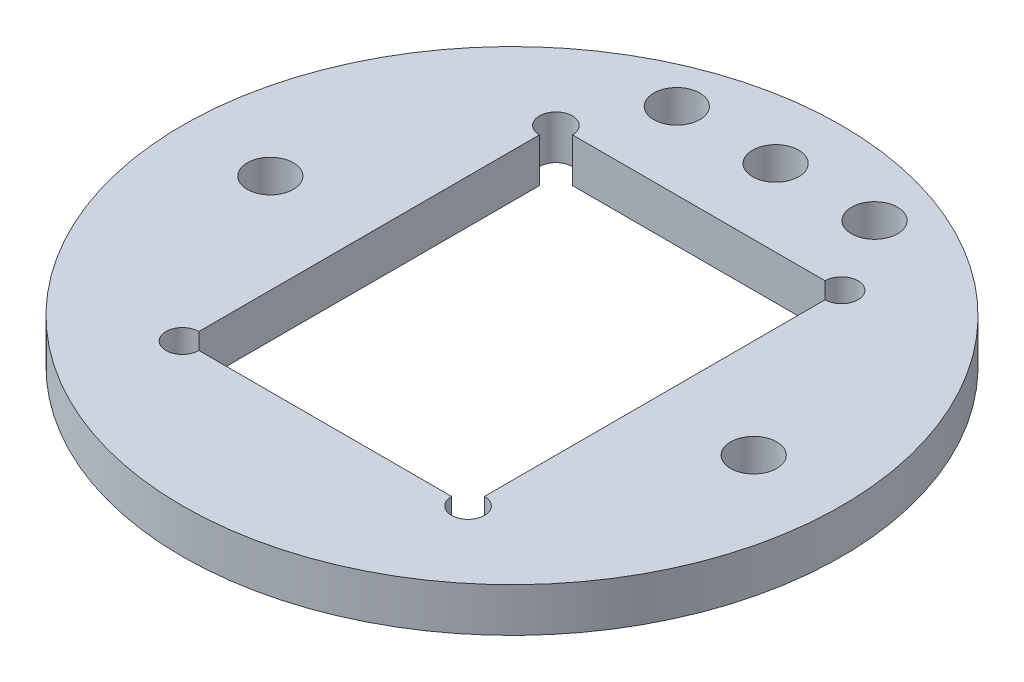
from build123d import *

# Parameters (mm, degrees)
SKETCH1_R                   = 3.81
EXTRUDE1_DEPTH              = 0.508
ALIGHNMENT_HOLES_DEPTH      = 2.54
ALIGHNMENT_HOLES_DEPTH_BACK = 6.412048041
SKETCH2_R                   = 0.2667
SKETCH16_R                  = 0.2667
CUT_EXTRUDE7_DEPTH          = 6.412048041
CHIPPOCKET_OUTSIDE_W        = 11.778
CHIPPOCKET_OUTSIDE_H        = 11.778
CHIPPOCKET_OUTSIDE_R        = 3.81
CHIPPOCKET_OUTSIDE_R_2      = 0.2667
CUT_EXTRUDE8_DEPTH          = 6.412048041


with BuildPart() as part:
    # Sketch1 → Extrude1 (new body)
    with BuildSketch(Plane(origin=(0, 0, 0), x_dir=(1, 0, 0), z_dir=(0, 1, 0))):
        with Locations(Location((0, 0, 0), (0, 0, 270))):
            Circle(SKETCH1_R)
        with BuildLine():
            Line((-0.762, -2.0828), (0.762, -2.0828))
            ThreePointArc((0.762, -2.0828), (1.031407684, -1.971207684), (1.143, -1.7018))
            Line((1.143, -1.7018), (1.143, -1.5748))
            ThreePointArc((1.143, -1.5748), (1.031407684, -1.305392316), (0.762, -1.1938))
            Line((0.762, -1.1938), (-0.762, -1.1938))
            ThreePointArc((-0.762, -1.1938), (-1.031407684, -1.305392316), (-1.143, -1.5748))
            Line((-1.143, -1.5748), (-1.143, -1.7018))
            ThreePointArc((-1.143, -1.7018), (-1.031407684, -1.971207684), (-0.762, -2.0828))
        make_face(mode=Mode.SUBTRACT)
    extrude(amount=EXTRUDE1_DEPTH)

    # Sketch2 → Alighnment holes (cut, two sides: drawn at the far end of the back side and taken through both)
    with BuildSketch(Plane(origin=(0, 0.508, 0), x_dir=(1, 0, 0), z_dir=(0, 1, 0)).offset(-ALIGHNMENT_HOLES_DEPTH_BACK)):
        with Locations(Location((2.794, 0, 0), (0, 0, 270))):
            Circle(SKETCH2_R)
        with Locations(Location((-2.794, 0, 0), (0, 0, 270))):
            Circle(SKETCH2_R)
    extrude(amount=ALIGHNMENT_HOLES_DEPTH + ALIGHNMENT_HOLES_DEPTH_BACK, mode=Mode.SUBTRACT)

    # Sketch16 → Cut-Extrude7 (cut, through all)
    with BuildSketch(Plane.XZ.offset(-0.508)):
        with Locations(Location((0, -3.048, 0), (0, 0, 270))):
            Circle(SKETCH16_R)
        with Locations(Location((1.143, -3.048, 0), (0, 0, 270))):
            Circle(SKETCH16_R)
        with Locations(Location((-1.143, -3.048, 0), (0, 0, 270))):
            Circle(SKETCH16_R)
    extrude(amount=CUT_EXTRUDE7_DEPTH, mode=Mode.SUBTRACT)

    # ChipPocket outside → Cut-Extrude8 (cut, through all)
    # profile 1 of 4: a face of its own
    with BuildSketch(Plane(origin=(0, 0.508, 0), x_dir=(1, 0, 0), z_dir=(0, 1, 0))):
        Rectangle(CHIPPOCKET_OUTSIDE_W, CHIPPOCKET_OUTSIDE_H)
        with Locations(Location((0, 0, 0), (0, 0, 270))):
            Circle(CHIPPOCKET_OUTSIDE_R, mode=Mode.SUBTRACT)
    # profile 2 of 4: a face of its own
    with BuildSketch(Plane(origin=(0, 0.508, 0), x_dir=(1, 0, 0), z_dir=(0, 1, 0))):
        with Locations(Location((2.794, 0, 0), (0, 0, 270))):
            Circle(CHIPPOCKET_OUTSIDE_R_2)
    # profile 3 of 4: a face of its own
    with BuildSketch(Plane(origin=(0, 0.508, 0), x_dir=(1, 0, 0), z_dir=(0, 1, 0))):
        with Locations(Location((-2.794, 0, 0), (0, 0, 270))):
            Circle(CHIPPOCKET_OUTSIDE_R_2)
    # profile 4 of 4: a face of its own
    with BuildSketch(Plane(origin=(0, 0.508, 0), x_dir=(1, 0, 0), z_dir=(0, 1, 0))):
        with BuildLine():
            Line((-1.4605, 2.159), (1.4605, 2.159))
            ThreePointArc((1.4605, 2.159), (1.785703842, 2.293703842), (1.651, 1.9685))
            Line((1.651, 1.9685), (1.651, -1.9685))
            ThreePointArc((1.651, -1.9685), (1.785703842, -2.293703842), (1.4605, -2.159))
            Line((1.4605, -2.159), (-1.4605, -2.159))
            ThreePointArc((-1.4605, -2.159), (-1.785703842, -2.293703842), (-1.651, -1.9685))
            Line((-1.651, -1.9685), (-1.651, 1.9685))
            ThreePointArc((-1.651, 1.9685), (-1.785703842, 2.293703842), (-1.4605, 2.159))
        make_face()
    extrude(amount=-CUT_EXTRUDE8_DEPTH, mode=Mode.SUBTRACT)


solid = part.part
